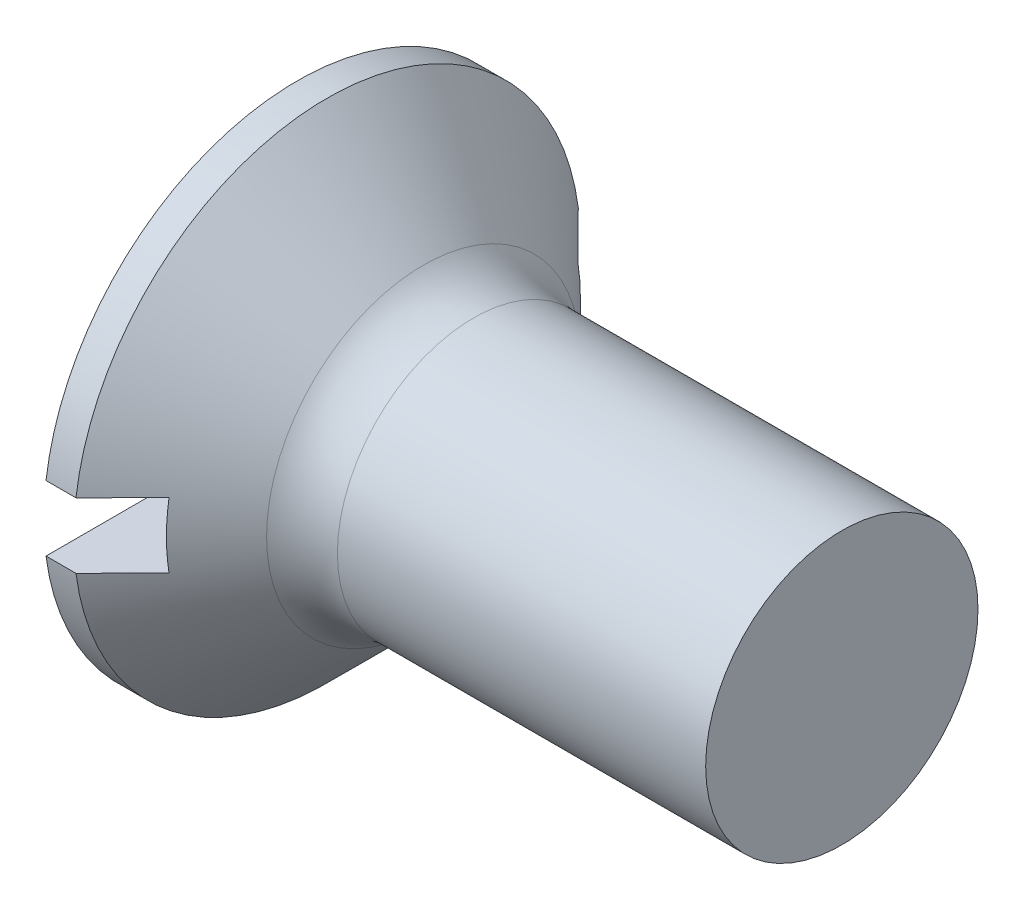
from build123d import *

# Parameters (mm, degrees)
FILLET1_R  = 1.3
SKETCH2_W  = 9.3
SKETCH2_H  = 1.2
SLOT_DEPTH = 1.4


with BuildPart() as part:
    # BodySke → Base-Revolve (revolve)
    with BuildSketch(Plane.XY, mode=Mode.PRIVATE) as base_revolve_sk:
        Polygon((0, 0), (0, 4.65), (0.55, 4.65), (2.7, 2.5), (10, 2.5), (10, 0), align=None)
    revolve(base_revolve_sk.sketch.rotate(Axis((-6.35, 0, 0), (1, 0, 0)), 90), axis=Axis((-6.35, 0, 0), (1, 0, 0)))

    # Fillet1
    fillet1_edges = [part.edges().sort_by_distance(p)[0] for p in [
        (2.7, 0, -2.5),
    ]]
    fillet(fillet1_edges, radius=FILLET1_R)

    # Sketch2 → Slot (cut)
    with BuildSketch(Plane.ZY):
        Rectangle(SKETCH2_W, SKETCH2_H)
    extrude(amount=-SLOT_DEPTH, mode=Mode.SUBTRACT)


solid = part.part
